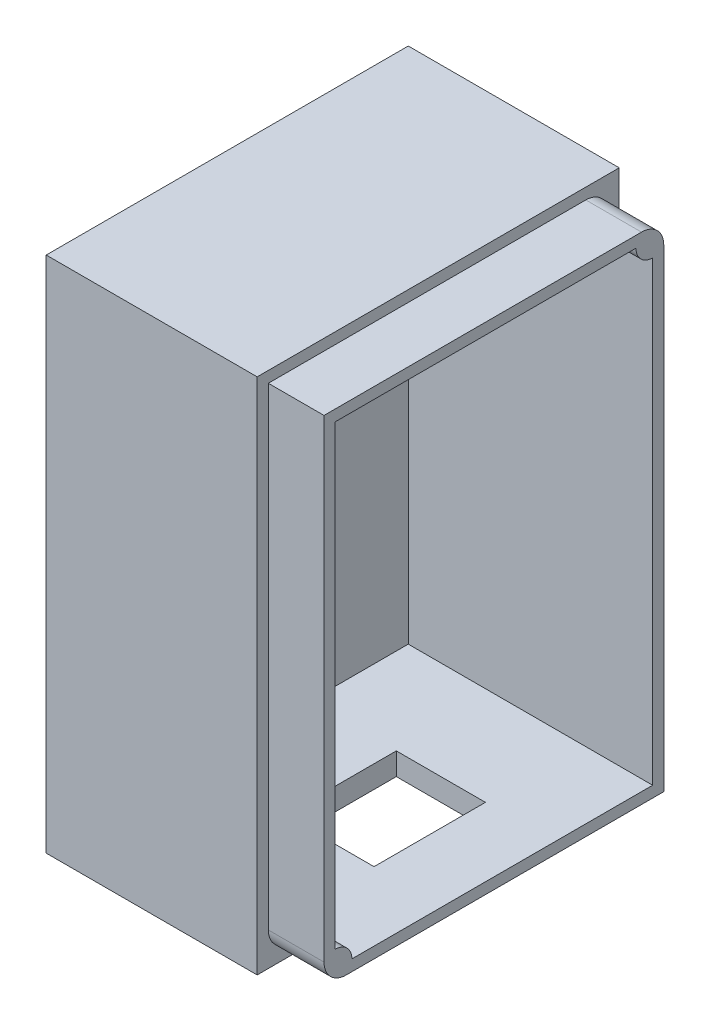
ISO-10303-21;
HEADER;
FILE_DESCRIPTION(('STEP AP214'),'2;1');
FILE_NAME('part.step','',(''),(''),'','','');
FILE_SCHEMA(('AUTOMOTIVE_DESIGN { 1 0 10303 214 1 1 1 1 }'));
ENDSEC;
DATA;
#1=APPLICATION_CONTEXT('core data for automotive mechanical design processes');
#2=APPLICATION_PROTOCOL_DEFINITION('international standard','automotive_design',2000,#1);
#3=PRODUCT_CONTEXT('',#1,'mechanical');
#4=PRODUCT('Part','Part','',(#3));
#5=PRODUCT_RELATED_PRODUCT_CATEGORY('part','',(#4));
#6=PRODUCT_DEFINITION_FORMATION('','',#4);
#7=PRODUCT_DEFINITION_CONTEXT('part definition',#1,'design');
#8=PRODUCT_DEFINITION('design','',#6,#7);
#9=PRODUCT_DEFINITION_SHAPE('','',#8);
#10=(LENGTH_UNIT() NAMED_UNIT(*) SI_UNIT(.MILLI.,.METRE.));
#11=(NAMED_UNIT(*) PLANE_ANGLE_UNIT() SI_UNIT($,.RADIAN.));
#12=(NAMED_UNIT(*) SI_UNIT($,.STERADIAN.) SOLID_ANGLE_UNIT());
#13=UNCERTAINTY_MEASURE_WITH_UNIT(LENGTH_MEASURE(1.E-05),#10,'distance_accuracy_value','');
#14=(GEOMETRIC_REPRESENTATION_CONTEXT(3) GLOBAL_UNCERTAINTY_ASSIGNED_CONTEXT((#13)) GLOBAL_UNIT_ASSIGNED_CONTEXT((#10,
#11,#12)) REPRESENTATION_CONTEXT('',''));
#15=CARTESIAN_POINT('',(0.,0.,0.));
#16=DIRECTION('',(0.,0.,1.));
#17=DIRECTION('',(1.,0.,0.));
#18=AXIS2_PLACEMENT_3D('',#15,#16,#17);
#19=CARTESIAN_POINT('',(20.,16.141592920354,16.5022123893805));
#20=DIRECTION('',(0.,0.,-1.));
#21=DIRECTION('',(0.,1.,0.));
#22=AXIS2_PLACEMENT_3D('',#19,#20,#21);
#23=PLANE('',#22);
#24=DIRECTION('',(-1.,0.,0.));
#25=VECTOR('',#24,1.);
#26=CARTESIAN_POINT('',(20.,-28.358407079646,16.5022123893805));
#27=LINE('',#26,#25);
#28=CARTESIAN_POINT('',(16.9379247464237,-28.358407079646,16.5022123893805));
#29=VERTEX_POINT('',#28);
#30=CARTESIAN_POINT('',(-2.,-28.358407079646,16.5022123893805));
#31=VERTEX_POINT('',#30);
#32=EDGE_CURVE('E550',#29,#31,#27,.T.);
#33=ORIENTED_EDGE('',*,*,#32,.F.);
#34=DIRECTION('',(0.,-1.,0.));
#35=VECTOR('',#34,1.);
#36=CARTESIAN_POINT('',(16.9379247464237,18.141592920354,16.5022123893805));
#37=LINE('',#36,#35);
#38=CARTESIAN_POINT('',(16.9379247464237,18.141592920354,16.5022123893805));
#39=VERTEX_POINT('',#38);
#40=EDGE_CURVE('E313',#39,#29,#37,.T.);
#41=ORIENTED_EDGE('',*,*,#40,.F.);
#42=DIRECTION('',(-1.,0.,0.));
#43=VECTOR('',#42,1.);
#44=CARTESIAN_POINT('',(20.,18.141592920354,16.5022123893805));
#45=LINE('',#44,#43);
#46=CARTESIAN_POINT('',(-2.,18.141592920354,16.5022123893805));
#47=VERTEX_POINT('',#46);
#48=EDGE_CURVE('E555',#39,#47,#45,.T.);
#49=ORIENTED_EDGE('',*,*,#48,.T.);
#50=DIRECTION('',(0.,-1.,0.));
#51=VECTOR('',#50,1.);
#52=CARTESIAN_POINT('',(-2.,16.141592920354,16.5022123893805));
#53=LINE('',#52,#51);
#54=EDGE_CURVE('E545',#47,#31,#53,.T.);
#55=ORIENTED_EDGE('',*,*,#54,.T.);
#56=EDGE_LOOP('',(#33,#41,#49,#55));
#57=FACE_BOUND('',#56,.T.);
#58=ADVANCED_FACE('F44',(#57),#23,.F.);
#59=CARTESIAN_POINT('',(20.,-28.358407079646,14.5022123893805));
#60=DIRECTION('',(0.,1.,0.));
#61=DIRECTION('',(0.,0.,1.));
#62=AXIS2_PLACEMENT_3D('',#59,#60,#61);
#63=PLANE('',#62);
#64=DIRECTION('',(0.,0.,-1.));
#65=VECTOR('',#64,1.);
#66=CARTESIAN_POINT('',(15.7624383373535,-28.358407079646,4.83698579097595));
#67=LINE('',#66,#65);
#68=CARTESIAN_POINT('',(15.7624383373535,-28.358407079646,4.83698579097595));
#69=VERTEX_POINT('',#68);
#70=CARTESIAN_POINT('',(15.7624383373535,-28.358407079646,-5.16301420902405));
#71=VERTEX_POINT('',#70);
#72=EDGE_CURVE('E327',#69,#71,#67,.T.);
#73=ORIENTED_EDGE('',*,*,#72,.T.);
#74=DIRECTION('',(1.,0.,0.));
#75=VECTOR('',#74,1.);
#76=CARTESIAN_POINT('',(7.76243833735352,-28.358407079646,-5.16301420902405));
#77=LINE('',#76,#75);
#78=CARTESIAN_POINT('',(7.76243833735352,-28.358407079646,-5.16301420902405));
#79=VERTEX_POINT('',#78);
#80=EDGE_CURVE('E319',#79,#71,#77,.T.);
#81=ORIENTED_EDGE('',*,*,#80,.F.);
#82=DIRECTION('',(0.,0.,-1.));
#83=VECTOR('',#82,1.);
#84=CARTESIAN_POINT('',(7.76243833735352,-28.358407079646,4.83698579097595));
#85=LINE('',#84,#83);
#86=CARTESIAN_POINT('',(7.76243833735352,-28.358407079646,4.83698579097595));
#87=VERTEX_POINT('',#86);
#88=EDGE_CURVE('E335',#87,#79,#85,.T.);
#89=ORIENTED_EDGE('',*,*,#88,.F.);
#90=DIRECTION('',(1.,0.,0.));
#91=VECTOR('',#90,1.);
#92=CARTESIAN_POINT('',(7.76243833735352,-28.358407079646,4.83698579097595));
#93=LINE('',#92,#91);
#94=EDGE_CURVE('E331',#87,#69,#93,.T.);
#95=ORIENTED_EDGE('',*,*,#94,.T.);
#96=EDGE_LOOP('',(#73,#81,#89,#95));
#97=FACE_BOUND('',#96,.T.);
#98=DIRECTION('',(0.,0.,-1.));
#99=VECTOR('',#98,1.);
#100=CARTESIAN_POINT('',(16.9379247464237,-28.358407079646,-15.9977876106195));
#101=LINE('',#100,#99);
#102=CARTESIAN_POINT('',(16.9379247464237,-28.358407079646,-15.9977876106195));
#103=VERTEX_POINT('',#102);
#104=EDGE_CURVE('E281',#29,#103,#101,.T.);
#105=ORIENTED_EDGE('',*,*,#104,.F.);
#106=ORIENTED_EDGE('',*,*,#32,.T.);
#107=DIRECTION('',(0.,0.,-1.));
#108=VECTOR('',#107,1.);
#109=CARTESIAN_POINT('',(-2.,-28.358407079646,14.5022123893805));
#110=LINE('',#109,#108);
#111=CARTESIAN_POINT('',(-2.,-28.358407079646,-15.9977876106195));
#112=VERTEX_POINT('',#111);
#113=EDGE_CURVE('E549',#31,#112,#110,.T.);
#114=ORIENTED_EDGE('',*,*,#113,.T.);
#115=DIRECTION('',(-1.,0.,0.));
#116=VECTOR('',#115,1.);
#117=CARTESIAN_POINT('',(20.,-28.358407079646,-15.9977876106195));
#118=LINE('',#117,#116);
#119=EDGE_CURVE('E554',#103,#112,#118,.T.);
#120=ORIENTED_EDGE('',*,*,#119,.F.);
#121=EDGE_LOOP('',(#105,#106,#114,#120));
#122=FACE_BOUND('',#121,.T.);
#123=ADVANCED_FACE('F685',(#97,#122),#63,.F.);
#124=CARTESIAN_POINT('',(7.,6.14159292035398,0.252212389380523));
#125=DIRECTION('',(-1.,0.,0.));
#126=DIRECTION('',(0.,0.,1.));
#127=AXIS2_PLACEMENT_3D('',#124,#125,#126);
#128=CYLINDRICAL_SURFACE('',#127,5.);
#129=CARTESIAN_POINT('',(-2.,6.14159292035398,0.252212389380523));
#130=DIRECTION('',(-1.,0.,0.));
#131=DIRECTION('',(0.,0.,1.));
#132=AXIS2_PLACEMENT_3D('',#129,#130,#131);
#133=CIRCLE('',#132,5.);
#134=CARTESIAN_POINT('',(-2.,6.14159292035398,5.25221238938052));
#135=VERTEX_POINT('',#134);
#136=EDGE_CURVE('E508',#135,#135,#133,.T.);
#137=ORIENTED_EDGE('',*,*,#136,.T.);
#138=EDGE_LOOP('',(#137));
#139=FACE_BOUND('',#138,.T.);
#140=CARTESIAN_POINT('',(-0.999999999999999,6.14159292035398,0.252212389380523));
#141=DIRECTION('',(1.,0.,0.));
#142=DIRECTION('',(0.,0.,-1.));
#143=AXIS2_PLACEMENT_3D('',#140,#141,#142);
#144=CIRCLE('',#143,5.);
#145=CARTESIAN_POINT('',(-0.999999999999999,6.14159292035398,-4.74778761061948));
#146=VERTEX_POINT('',#145);
#147=EDGE_CURVE('E435',#146,#146,#144,.F.);
#148=ORIENTED_EDGE('',*,*,#147,.F.);
#149=EDGE_LOOP('',(#148));
#150=FACE_BOUND('',#149,.T.);
#151=ADVANCED_FACE('F691',(#139,#150),#128,.F.);
#152=CARTESIAN_POINT('',(20.,16.141592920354,-15.9977876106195));
#153=DIRECTION('',(0.,0.,1.));
#154=DIRECTION('',(0.,-1.,0.));
#155=AXIS2_PLACEMENT_3D('',#152,#153,#154);
#156=PLANE('',#155);
#157=DIRECTION('',(-1.,0.,0.));
#158=VECTOR('',#157,1.);
#159=CARTESIAN_POINT('',(20.,18.141592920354,-15.9977876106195));
#160=LINE('',#159,#158);
#161=CARTESIAN_POINT('',(16.9379247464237,18.141592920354,-15.9977876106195));
#162=VERTEX_POINT('',#161);
#163=CARTESIAN_POINT('',(-2.,18.141592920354,-15.9977876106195));
#164=VERTEX_POINT('',#163);
#165=EDGE_CURVE('E558',#162,#164,#160,.T.);
#166=ORIENTED_EDGE('',*,*,#165,.F.);
#167=DIRECTION('',(0.,1.,0.));
#168=VECTOR('',#167,1.);
#169=CARTESIAN_POINT('',(16.9379247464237,18.141592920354,-15.9977876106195));
#170=LINE('',#169,#168);
#171=EDGE_CURVE('E307',#103,#162,#170,.T.);
#172=ORIENTED_EDGE('',*,*,#171,.F.);
#173=ORIENTED_EDGE('',*,*,#119,.T.);
#174=DIRECTION('',(0.,1.,0.));
#175=VECTOR('',#174,1.);
#176=CARTESIAN_POINT('',(-2.,16.141592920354,-15.9977876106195));
#177=LINE('',#176,#175);
#178=EDGE_CURVE('E563',#112,#164,#177,.T.);
#179=ORIENTED_EDGE('',*,*,#178,.T.);
#180=EDGE_LOOP('',(#166,#172,#173,#179));
#181=FACE_BOUND('',#180,.T.);
#182=ADVANCED_FACE('F698',(#181),#156,.F.);
#183=CARTESIAN_POINT('',(20.,18.141592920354,14.5022123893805));
#184=DIRECTION('',(0.,-1.,0.));
#185=DIRECTION('',(0.,0.,-1.));
#186=AXIS2_PLACEMENT_3D('',#183,#184,#185);
#187=PLANE('',#186);
#188=ORIENTED_EDGE('',*,*,#48,.F.);
#189=DIRECTION('',(0.,0.,1.));
#190=VECTOR('',#189,1.);
#191=CARTESIAN_POINT('',(16.9379247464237,18.141592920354,-15.9977876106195));
#192=LINE('',#191,#190);
#193=EDGE_CURVE('E310',#162,#39,#192,.T.);
#194=ORIENTED_EDGE('',*,*,#193,.F.);
#195=ORIENTED_EDGE('',*,*,#165,.T.);
#196=DIRECTION('',(0.,0.,1.));
#197=VECTOR('',#196,1.);
#198=CARTESIAN_POINT('',(-2.,18.141592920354,14.5022123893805));
#199=LINE('',#198,#197);
#200=EDGE_CURVE('E559',#164,#47,#199,.T.);
#201=ORIENTED_EDGE('',*,*,#200,.T.);
#202=EDGE_LOOP('',(#188,#194,#195,#201));
#203=FACE_BOUND('',#202,.T.);
#204=ADVANCED_FACE('F701',(#203),#187,.F.);
#205=CARTESIAN_POINT('',(-2.,0.,0.));
#206=DIRECTION('',(1.,0.,0.));
#207=DIRECTION('',(0.,0.,-1.));
#208=AXIS2_PLACEMENT_3D('',#205,#206,#207);
#209=PLANE('',#208);
#210=ORIENTED_EDGE('',*,*,#136,.F.);
#211=EDGE_LOOP('',(#210));
#212=FACE_BOUND('',#211,.T.);
#213=DIRECTION('',(0.,0.933474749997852,0.358643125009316));
#214=VECTOR('',#213,1.);
#215=CARTESIAN_POINT('',(-2.,-17.7749650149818,13.8253044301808));
#216=LINE('',#215,#214);
#217=CARTESIAN_POINT('',(-2.,-17.7749650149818,13.8253044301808));
#218=VERTEX_POINT('',#217);
#219=CARTESIAN_POINT('',(-2.,-14.1924692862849,15.2017074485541));
#220=VERTEX_POINT('',#219);
#221=EDGE_CURVE('E448',#218,#220,#216,.T.);
#222=ORIENTED_EDGE('',*,*,#221,.F.);
#223=DIRECTION('',(0.,0.15614331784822,0.987734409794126));
#224=VECTOR('',#223,1.);
#225=CARTESIAN_POINT('',(-2.,-18.3742128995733,10.0345706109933));
#226=LINE('',#225,#224);
#227=CARTESIAN_POINT('',(-2.,-18.1794698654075,11.2664798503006));
#228=VERTEX_POINT('',#227);
#229=EDGE_CURVE('E449',#228,#218,#226,.T.);
#230=ORIENTED_EDGE('',*,*,#229,.F.);
#231=DIRECTION('',(0.,0.320865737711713,0.947124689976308));
#232=VECTOR('',#231,1.);
#233=CARTESIAN_POINT('',(-2.,-18.1893486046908,11.2373199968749));
#234=LINE('',#233,#232);
#235=CARTESIAN_POINT('',(-2.,-18.1893486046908,11.2373199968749));
#236=VERTEX_POINT('',#235);
#237=EDGE_CURVE('E519',#236,#228,#234,.T.);
#238=ORIENTED_EDGE('',*,*,#237,.F.);
#239=DIRECTION('',(0.,-0.659801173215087,0.751440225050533));
#240=VECTOR('',#239,1.);
#241=CARTESIAN_POINT('',(-2.,-16.284666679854,9.06809891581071));
#242=LINE('',#241,#240);
#243=CARTESIAN_POINT('',(-2.,-18.184883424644,11.2322346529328));
#244=VERTEX_POINT('',#243);
#245=EDGE_CURVE('E516',#244,#236,#242,.T.);
#246=ORIENTED_EDGE('',*,*,#245,.F.);
#247=CARTESIAN_POINT('',(-2.,-18.3742128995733,10.0345706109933));
#248=VERTEX_POINT('',#247);
#249=EDGE_CURVE('E445',#248,#244,#226,.T.);
#250=ORIENTED_EDGE('',*,*,#249,.F.);
#251=DIRECTION('',(0.,-0.777331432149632,0.629091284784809));
#252=VECTOR('',#251,1.);
#253=CARTESIAN_POINT('',(-2.,-15.390965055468,7.62023981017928));
#254=LINE('',#253,#252);
#255=CARTESIAN_POINT('',(-2.,-15.390965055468,7.62023981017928));
#256=VERTEX_POINT('',#255);
#257=EDGE_CURVE('E465',#256,#248,#254,.T.);
#258=ORIENTED_EDGE('',*,*,#257,.F.);
#259=DIRECTION('',(0.,-0.933474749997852,-0.358643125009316));
#260=VECTOR('',#259,1.);
#261=CARTESIAN_POINT('',(-2.,-11.8084693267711,8.99664282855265));
#262=LINE('',#261,#260);
#263=CARTESIAN_POINT('',(-2.,-11.8084693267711,8.99664282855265));
#264=VERTEX_POINT('',#263);
#265=EDGE_CURVE('E461',#264,#256,#262,.T.);
#266=ORIENTED_EDGE('',*,*,#265,.F.);
#267=DIRECTION('',(0.,-0.15614331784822,-0.987734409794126));
#268=VECTOR('',#267,1.);
#269=CARTESIAN_POINT('',(-2.,-11.2092214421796,12.7873766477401));
#270=LINE('',#269,#268);
#271=CARTESIAN_POINT('',(-2.,-11.2092214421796,12.7873766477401));
#272=VERTEX_POINT('',#271);
#273=EDGE_CURVE('E457',#272,#264,#270,.T.);
#274=ORIENTED_EDGE('',*,*,#273,.F.);
#275=DIRECTION('',(0.,0.777331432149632,-0.629091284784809));
#276=VECTOR('',#275,1.);
#277=CARTESIAN_POINT('',(-2.,-14.1924692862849,15.2017074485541));
#278=LINE('',#277,#276);
#279=EDGE_CURVE('E453',#220,#272,#278,.T.);
#280=ORIENTED_EDGE('',*,*,#279,.F.);
#281=EDGE_LOOP('',(#222,#230,#238,#246,#250,#258,#266,#274,#280));
#282=FACE_BOUND('',#281,.T.);
#283=ORIENTED_EDGE('',*,*,#54,.F.);
#284=ORIENTED_EDGE('',*,*,#200,.F.);
#285=ORIENTED_EDGE('',*,*,#178,.F.);
#286=ORIENTED_EDGE('',*,*,#113,.F.);
#287=EDGE_LOOP('',(#283,#284,#285,#286));
#288=FACE_BOUND('',#287,.T.);
#289=ADVANCED_FACE('F651',(#212,#282,#288),#209,.F.);
#290=CARTESIAN_POINT('',(20.,16.141592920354,14.5022123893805));
#291=DIRECTION('',(0.,0.,-1.));
#292=DIRECTION('',(0.,1.,0.));
#293=AXIS2_PLACEMENT_3D('',#290,#291,#292);
#294=PLANE('',#293);
#295=DIRECTION('',(1.,0.,0.));
#296=VECTOR('',#295,1.);
#297=CARTESIAN_POINT('',(-2.,-24.858407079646,14.5022123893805));
#298=LINE('',#297,#296);
#299=CARTESIAN_POINT('',(0.,-24.858407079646,14.5022123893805));
#300=VERTEX_POINT('',#299);
#301=CARTESIAN_POINT('',(21.9379247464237,-24.858407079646,14.5022123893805));
#302=VERTEX_POINT('',#301);
#303=EDGE_CURVE('E380',#300,#302,#298,.T.);
#304=ORIENTED_EDGE('',*,*,#303,.F.);
#305=DIRECTION('',(0.,-1.,0.));
#306=VECTOR('',#305,1.);
#307=CARTESIAN_POINT('',(0.,16.141592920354,14.5022123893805));
#308=LINE('',#307,#306);
#309=CARTESIAN_POINT('',(0.,-16.0131119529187,14.5022123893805));
#310=VERTEX_POINT('',#309);
#311=EDGE_CURVE('E523',#310,#300,#308,.T.);
#312=ORIENTED_EDGE('',*,*,#311,.F.);
#313=DIRECTION('',(-1.,0.,0.));
#314=VECTOR('',#313,1.);
#315=CARTESIAN_POINT('',(20.,-16.0131119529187,14.5022123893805));
#316=LINE('',#315,#314);
#317=CARTESIAN_POINT('',(5.9379247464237,-16.0131119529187,14.5022123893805));
#318=VERTEX_POINT('',#317);
#319=EDGE_CURVE('E473',#318,#310,#316,.T.);
#320=ORIENTED_EDGE('',*,*,#319,.F.);
#321=DIRECTION('',(0.,-1.,0.));
#322=VECTOR('',#321,1.);
#323=CARTESIAN_POINT('',(5.9379247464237,-26.358407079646,14.5022123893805));
#324=LINE('',#323,#322);
#325=CARTESIAN_POINT('',(5.9379247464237,-13.3281440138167,14.5022123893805));
#326=VERTEX_POINT('',#325);
#327=EDGE_CURVE('E384',#326,#318,#324,.T.);
#328=ORIENTED_EDGE('',*,*,#327,.F.);
#329=DIRECTION('',(1.,0.,0.));
#330=VECTOR('',#329,1.);
#331=CARTESIAN_POINT('',(20.,-13.3281440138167,14.5022123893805));
#332=LINE('',#331,#330);
#333=CARTESIAN_POINT('',(0.,-13.3281440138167,14.5022123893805));
#334=VERTEX_POINT('',#333);
#335=EDGE_CURVE('E494',#334,#326,#332,.T.);
#336=ORIENTED_EDGE('',*,*,#335,.F.);
#337=CARTESIAN_POINT('',(0.,16.141592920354,14.5022123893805));
#338=VERTEX_POINT('',#337);
#339=EDGE_CURVE('E524',#338,#334,#308,.T.);
#340=ORIENTED_EDGE('',*,*,#339,.F.);
#341=DIRECTION('',(-1.,0.,0.));
#342=VECTOR('',#341,1.);
#343=CARTESIAN_POINT('',(20.,16.141592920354,14.5022123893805));
#344=LINE('',#343,#342);
#345=CARTESIAN_POINT('',(21.9379247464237,16.141592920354,14.5022123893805));
#346=VERTEX_POINT('',#345);
#347=EDGE_CURVE('E537',#346,#338,#344,.T.);
#348=ORIENTED_EDGE('',*,*,#347,.F.);
#349=DIRECTION('',(0.,-1.,0.));
#350=VECTOR('',#349,1.);
#351=CARTESIAN_POINT('',(21.9379247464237,-26.358407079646,14.5022123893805));
#352=LINE('',#351,#350);
#353=EDGE_CURVE('E385',#346,#302,#352,.T.);
#354=ORIENTED_EDGE('',*,*,#353,.T.);
#355=EDGE_LOOP('',(#304,#312,#320,#328,#336,#340,#348,#354));
#356=FACE_BOUND('',#355,.T.);
#357=ADVANCED_FACE('F666',(#356),#294,.T.);
#358=CARTESIAN_POINT('',(20.,-26.358407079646,14.5022123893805));
#359=DIRECTION('',(0.,1.,0.));
#360=DIRECTION('',(0.,0.,1.));
#361=AXIS2_PLACEMENT_3D('',#358,#359,#360);
#362=PLANE('',#361);
#363=DIRECTION('',(-1.,0.,0.));
#364=VECTOR('',#363,1.);
#365=CARTESIAN_POINT('',(20.,-26.358407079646,-5.16301420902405));
#366=LINE('',#365,#364);
#367=CARTESIAN_POINT('',(15.7624383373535,-26.358407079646,-5.16301420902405));
#368=VERTEX_POINT('',#367);
#369=CARTESIAN_POINT('',(7.76243833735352,-26.358407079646,-5.16301420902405));
#370=VERTEX_POINT('',#369);
#371=EDGE_CURVE('E615',#368,#370,#366,.T.);
#372=ORIENTED_EDGE('',*,*,#371,.F.);
#373=DIRECTION('',(0.,0.,1.));
#374=VECTOR('',#373,1.);
#375=CARTESIAN_POINT('',(15.7624383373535,-26.358407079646,14.5022123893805));
#376=LINE('',#375,#374);
#377=CARTESIAN_POINT('',(15.7624383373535,-26.358407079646,4.83698579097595));
#378=VERTEX_POINT('',#377);
#379=EDGE_CURVE('E601',#368,#378,#376,.T.);
#380=ORIENTED_EDGE('',*,*,#379,.T.);
#381=DIRECTION('',(-1.,0.,0.));
#382=VECTOR('',#381,1.);
#383=CARTESIAN_POINT('',(20.,-26.358407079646,4.83698579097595));
#384=LINE('',#383,#382);
#385=CARTESIAN_POINT('',(7.76243833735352,-26.358407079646,4.83698579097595));
#386=VERTEX_POINT('',#385);
#387=EDGE_CURVE('E608',#378,#386,#384,.T.);
#388=ORIENTED_EDGE('',*,*,#387,.T.);
#389=DIRECTION('',(0.,0.,1.));
#390=VECTOR('',#389,1.);
#391=CARTESIAN_POINT('',(7.76243833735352,-26.358407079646,14.5022123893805));
#392=LINE('',#391,#390);
#393=EDGE_CURVE('E612',#370,#386,#392,.T.);
#394=ORIENTED_EDGE('',*,*,#393,.F.);
#395=EDGE_LOOP('',(#372,#380,#388,#394));
#396=FACE_BOUND('',#395,.T.);
#397=DIRECTION('',(1.,0.,0.));
#398=VECTOR('',#397,1.);
#399=CARTESIAN_POINT('',(-2.,-26.358407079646,13.0022123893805));
#400=LINE('',#399,#398);
#401=CARTESIAN_POINT('',(21.9379247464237,-26.358407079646,13.0022123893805));
#402=VERTEX_POINT('',#401);
#403=CARTESIAN_POINT('',(0.,-26.358407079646,13.0022123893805));
#404=VERTEX_POINT('',#403);
#405=EDGE_CURVE('E376',#402,#404,#400,.F.);
#406=ORIENTED_EDGE('',*,*,#405,.F.);
#407=DIRECTION('',(0.,0.,-1.));
#408=VECTOR('',#407,1.);
#409=CARTESIAN_POINT('',(21.9379247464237,-26.358407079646,-13.9977876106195));
#410=LINE('',#409,#408);
#411=CARTESIAN_POINT('',(21.9379247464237,-26.358407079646,-13.9977876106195));
#412=VERTEX_POINT('',#411);
#413=EDGE_CURVE('E388',#402,#412,#410,.T.);
#414=ORIENTED_EDGE('',*,*,#413,.T.);
#415=DIRECTION('',(-1.,0.,0.));
#416=VECTOR('',#415,1.);
#417=CARTESIAN_POINT('',(20.,-26.358407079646,-13.9977876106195));
#418=LINE('',#417,#416);
#419=CARTESIAN_POINT('',(0.,-26.358407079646,-13.9977876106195));
#420=VERTEX_POINT('',#419);
#421=EDGE_CURVE('E541',#412,#420,#418,.T.);
#422=ORIENTED_EDGE('',*,*,#421,.T.);
#423=DIRECTION('',(0.,0.,-1.));
#424=VECTOR('',#423,1.);
#425=CARTESIAN_POINT('',(0.,-26.358407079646,14.5022123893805));
#426=LINE('',#425,#424);
#427=EDGE_CURVE('E528',#404,#420,#426,.T.);
#428=ORIENTED_EDGE('',*,*,#427,.F.);
#429=EDGE_LOOP('',(#406,#414,#422,#428));
#430=FACE_BOUND('',#429,.T.);
#431=ADVANCED_FACE('F770',(#396,#430),#362,.T.);
#432=CARTESIAN_POINT('',(20.,16.141592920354,-13.9977876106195));
#433=DIRECTION('',(0.,0.,1.));
#434=DIRECTION('',(0.,-1.,0.));
#435=AXIS2_PLACEMENT_3D('',#432,#433,#434);
#436=PLANE('',#435);
#437=DIRECTION('',(1.,0.,0.));
#438=VECTOR('',#437,1.);
#439=CARTESIAN_POINT('',(-2.,14.6423659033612,-13.9977876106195));
#440=LINE('',#439,#438);
#441=CARTESIAN_POINT('',(0.,14.6423659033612,-13.9977876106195));
#442=VERTEX_POINT('',#441);
#443=CARTESIAN_POINT('',(21.9379247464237,14.6423659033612,-13.9977876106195));
#444=VERTEX_POINT('',#443);
#445=EDGE_CURVE('E364',#442,#444,#440,.T.);
#446=ORIENTED_EDGE('',*,*,#445,.F.);
#447=DIRECTION('',(0.,1.,0.));
#448=VECTOR('',#447,1.);
#449=CARTESIAN_POINT('',(0.,16.141592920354,-13.9977876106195));
#450=LINE('',#449,#448);
#451=EDGE_CURVE('E531',#420,#442,#450,.T.);
#452=ORIENTED_EDGE('',*,*,#451,.F.);
#453=ORIENTED_EDGE('',*,*,#421,.F.);
#454=DIRECTION('',(0.,1.,0.));
#455=VECTOR('',#454,1.);
#456=CARTESIAN_POINT('',(21.9379247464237,16.141592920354,-13.9977876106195));
#457=LINE('',#456,#455);
#458=EDGE_CURVE('E391',#412,#444,#457,.T.);
#459=ORIENTED_EDGE('',*,*,#458,.T.);
#460=EDGE_LOOP('',(#446,#452,#453,#459));
#461=FACE_BOUND('',#460,.T.);
#462=ADVANCED_FACE('F777',(#461),#436,.T.);
#463=CARTESIAN_POINT('',(20.,16.141592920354,14.5022123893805));
#464=DIRECTION('',(0.,-1.,0.));
#465=DIRECTION('',(0.,0.,-1.));
#466=AXIS2_PLACEMENT_3D('',#463,#464,#465);
#467=PLANE('',#466);
#468=DIRECTION('',(1.,0.,0.));
#469=VECTOR('',#468,1.);
#470=CARTESIAN_POINT('',(-2.,16.141592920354,-12.4985605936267));
#471=LINE('',#470,#469);
#472=CARTESIAN_POINT('',(21.9379247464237,16.141592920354,-12.4985605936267));
#473=VERTEX_POINT('',#472);
#474=CARTESIAN_POINT('',(0.,16.141592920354,-12.4985605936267));
#475=VERTEX_POINT('',#474);
#476=EDGE_CURVE('E360',#473,#475,#471,.F.);
#477=ORIENTED_EDGE('',*,*,#476,.F.);
#478=DIRECTION('',(0.,0.,1.));
#479=VECTOR('',#478,1.);
#480=CARTESIAN_POINT('',(21.9379247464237,16.141592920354,14.5022123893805));
#481=LINE('',#480,#479);
#482=EDGE_CURVE('E394',#473,#346,#481,.T.);
#483=ORIENTED_EDGE('',*,*,#482,.T.);
#484=ORIENTED_EDGE('',*,*,#347,.T.);
#485=DIRECTION('',(0.,0.,1.));
#486=VECTOR('',#485,1.);
#487=CARTESIAN_POINT('',(0.,16.141592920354,14.5022123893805));
#488=LINE('',#487,#486);
#489=EDGE_CURVE('E534',#475,#338,#488,.T.);
#490=ORIENTED_EDGE('',*,*,#489,.F.);
#491=EDGE_LOOP('',(#477,#483,#484,#490));
#492=FACE_BOUND('',#491,.T.);
#493=ADVANCED_FACE('F780',(#492),#467,.T.);
#494=CARTESIAN_POINT('',(0.,0.,0.));
#495=DIRECTION('',(1.,0.,0.));
#496=DIRECTION('',(0.,0.,-1.));
#497=AXIS2_PLACEMENT_3D('',#494,#495,#496);
#498=PLANE('',#497);
#499=CARTESIAN_POINT('',(0.,16.141592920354,-13.9977876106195));
#500=DIRECTION('',(1.,0.,0.));
#501=DIRECTION('',(0.,0.,-1.));
#502=AXIS2_PLACEMENT_3D('',#499,#500,#501);
#503=CIRCLE('',#502,1.4992270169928);
#504=EDGE_CURVE('E356',#475,#442,#503,.T.);
#505=ORIENTED_EDGE('',*,*,#504,.F.);
#506=ORIENTED_EDGE('',*,*,#489,.T.);
#507=ORIENTED_EDGE('',*,*,#339,.T.);
#508=DIRECTION('',(0.,-0.777331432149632,0.629091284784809));
#509=VECTOR('',#508,1.);
#510=CARTESIAN_POINT('',(0.,1.81707122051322,2.2452489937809));
#511=LINE('',#510,#509);
#512=CARTESIAN_POINT('',(0.,-11.2092214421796,12.7873766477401));
#513=VERTEX_POINT('',#512);
#514=EDGE_CURVE('E497',#513,#334,#511,.T.);
#515=ORIENTED_EDGE('',*,*,#514,.F.);
#516=DIRECTION('',(0.,0.15614331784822,0.987734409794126));
#517=VECTOR('',#516,1.);
#518=CARTESIAN_POINT('',(0.,-12.908105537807,2.0405428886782));
#519=LINE('',#518,#517);
#520=CARTESIAN_POINT('',(0.,-11.8084693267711,8.99664282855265));
#521=VERTEX_POINT('',#520);
#522=EDGE_CURVE('E592',#521,#513,#519,.T.);
#523=ORIENTED_EDGE('',*,*,#522,.F.);
#524=DIRECTION('',(0.,0.933474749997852,0.358643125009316));
#525=VECTOR('',#524,1.);
#526=CARTESIAN_POINT('',(0.,-4.53079786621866,11.7927407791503));
#527=LINE('',#526,#525);
#528=CARTESIAN_POINT('',(0.,-15.390965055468,7.62023981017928));
#529=VERTEX_POINT('',#528);
#530=EDGE_CURVE('E595',#529,#521,#527,.T.);
#531=ORIENTED_EDGE('',*,*,#530,.F.);
#532=DIRECTION('',(0.,0.777331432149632,-0.629091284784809));
#533=VECTOR('',#532,1.);
#534=CARTESIAN_POINT('',(0.,-2.36467239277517,-2.92188784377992));
#535=LINE('',#534,#533);
#536=CARTESIAN_POINT('',(0.,-18.3742128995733,10.0345706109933));
#537=VERTEX_POINT('',#536);
#538=EDGE_CURVE('E598',#537,#529,#535,.T.);
#539=ORIENTED_EDGE('',*,*,#538,.F.);
#540=DIRECTION('',(0.,-0.15614331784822,-0.987734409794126));
#541=VECTOR('',#540,1.);
#542=CARTESIAN_POINT('',(0.,-19.4738491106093,3.07847067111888));
#543=LINE('',#542,#541);
#544=CARTESIAN_POINT('',(0.,-18.184883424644,11.2322346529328));
#545=VERTEX_POINT('',#544);
#546=EDGE_CURVE('E500',#545,#537,#543,.T.);
#547=ORIENTED_EDGE('',*,*,#546,.F.);
#548=DIRECTION('',(0.,0.659801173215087,-0.751440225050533));
#549=VECTOR('',#548,1.);
#550=CARTESIAN_POINT('',(0.,-4.69936536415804,-4.1262720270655));
#551=LINE('',#550,#549);
#552=CARTESIAN_POINT('',(0.,-18.1893486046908,11.2373199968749));
#553=VERTEX_POINT('',#552);
#554=EDGE_CURVE('E576',#553,#545,#551,.T.);
#555=ORIENTED_EDGE('',*,*,#554,.F.);
#556=DIRECTION('',(0.,-0.320865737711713,-0.947124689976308));
#557=VECTOR('',#556,1.);
#558=CARTESIAN_POINT('',(0.,-19.7316874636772,6.68467681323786));
#559=LINE('',#558,#557);
#560=CARTESIAN_POINT('',(0.,-18.1794698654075,11.2664798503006));
#561=VERTEX_POINT('',#560);
#562=EDGE_CURVE('E553',#561,#553,#559,.T.);
#563=ORIENTED_EDGE('',*,*,#562,.F.);
#564=CARTESIAN_POINT('',(0.,-17.7749650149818,13.8253044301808));
#565=VERTEX_POINT('',#564);
#566=EDGE_CURVE('E504',#565,#561,#543,.T.);
#567=ORIENTED_EDGE('',*,*,#566,.F.);
#568=DIRECTION('',(0.,-0.933474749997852,-0.358643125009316));
#569=VECTOR('',#568,1.);
#570=CARTESIAN_POINT('',(0.,-6.9147978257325,17.9978053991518));
#571=LINE('',#570,#569);
#572=EDGE_CURVE('E491',#310,#565,#571,.T.);
#573=ORIENTED_EDGE('',*,*,#572,.F.);
#574=ORIENTED_EDGE('',*,*,#311,.T.);
#575=CARTESIAN_POINT('',(0.,-26.358407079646,14.5022123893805));
#576=DIRECTION('',(1.,0.,0.));
#577=DIRECTION('',(0.,0.,-1.));
#578=AXIS2_PLACEMENT_3D('',#575,#576,#577);
#579=CIRCLE('',#578,1.5);
#580=EDGE_CURVE('E372',#404,#300,#579,.T.);
#581=ORIENTED_EDGE('',*,*,#580,.F.);
#582=ORIENTED_EDGE('',*,*,#427,.T.);
#583=ORIENTED_EDGE('',*,*,#451,.T.);
#584=EDGE_LOOP('',(#505,#506,#507,#515,#523,#531,#539,#547,#555,#563,#567,#573,#574,#581,#582,#583));
#585=FACE_BOUND('',#584,.T.);
#586=DIRECTION('',(0.,1.,0.));
#587=VECTOR('',#586,1.);
#588=CARTESIAN_POINT('',(0.,11.5863226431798,-5.18234597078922));
#589=LINE('',#588,#587);
#590=CARTESIAN_POINT('',(0.,0.696863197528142,-5.18234597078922));
#591=VERTEX_POINT('',#590);
#592=CARTESIAN_POINT('',(0.,11.5863226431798,-5.18234597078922));
#593=VERTEX_POINT('',#592);
#594=EDGE_CURVE('E397',#591,#593,#589,.T.);
#595=ORIENTED_EDGE('',*,*,#594,.F.);
#596=DIRECTION('',(0.,0.,-1.));
#597=VECTOR('',#596,1.);
#598=CARTESIAN_POINT('',(0.,0.696863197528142,5.68677074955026));
#599=LINE('',#598,#597);
#600=CARTESIAN_POINT('',(0.,0.696863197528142,5.68677074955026));
#601=VERTEX_POINT('',#600);
#602=EDGE_CURVE('E406',#601,#591,#599,.T.);
#603=ORIENTED_EDGE('',*,*,#602,.F.);
#604=DIRECTION('',(0.,-1.,0.));
#605=VECTOR('',#604,1.);
#606=CARTESIAN_POINT('',(0.,11.5863226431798,5.68677074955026));
#607=LINE('',#606,#605);
#608=CARTESIAN_POINT('',(0.,11.5863226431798,5.68677074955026));
#609=VERTEX_POINT('',#608);
#610=EDGE_CURVE('E425',#609,#601,#607,.T.);
#611=ORIENTED_EDGE('',*,*,#610,.F.);
#612=DIRECTION('',(0.,0.,1.));
#613=VECTOR('',#612,1.);
#614=CARTESIAN_POINT('',(0.,11.5863226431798,5.68677074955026));
#615=LINE('',#614,#613);
#616=EDGE_CURVE('E421',#593,#609,#615,.T.);
#617=ORIENTED_EDGE('',*,*,#616,.F.);
#618=EDGE_LOOP('',(#595,#603,#611,#617));
#619=FACE_BOUND('',#618,.T.);
#620=ADVANCED_FACE('F767',(#585,#619),#498,.T.);
#621=CARTESIAN_POINT('',(18.,-18.1893486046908,11.2373199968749));
#622=DIRECTION('',(0.,-0.947124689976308,0.320865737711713));
#623=DIRECTION('',(0.,-0.320865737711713,-0.947124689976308));
#624=AXIS2_PLACEMENT_3D('',#621,#622,#623);
#625=PLANE('',#624);
#626=ORIENTED_EDGE('',*,*,#237,.T.);
#627=DIRECTION('',(1.,0.,0.));
#628=VECTOR('',#627,1.);
#629=CARTESIAN_POINT('',(18.,-18.1794698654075,11.2664798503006));
#630=LINE('',#629,#628);
#631=EDGE_CURVE('E503',#228,#561,#630,.T.);
#632=ORIENTED_EDGE('',*,*,#631,.T.);
#633=ORIENTED_EDGE('',*,*,#562,.T.);
#634=DIRECTION('',(-1.,0.,0.));
#635=VECTOR('',#634,1.);
#636=CARTESIAN_POINT('',(18.,-18.1893486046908,11.2373199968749));
#637=LINE('',#636,#635);
#638=EDGE_CURVE('E512',#553,#236,#637,.T.);
#639=ORIENTED_EDGE('',*,*,#638,.T.);
#640=EDGE_LOOP('',(#626,#632,#633,#639));
#641=FACE_BOUND('',#640,.T.);
#642=ADVANCED_FACE('F809',(#641),#625,.F.);
#643=CARTESIAN_POINT('',(18.,-16.284666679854,9.06809891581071));
#644=DIRECTION('',(0.,-0.751440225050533,-0.659801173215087));
#645=DIRECTION('',(0.,0.659801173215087,-0.751440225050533));
#646=AXIS2_PLACEMENT_3D('',#643,#644,#645);
#647=PLANE('',#646);
#648=ORIENTED_EDGE('',*,*,#554,.T.);
#649=DIRECTION('',(-1.,0.,0.));
#650=VECTOR('',#649,1.);
#651=CARTESIAN_POINT('',(18.,-18.184883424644,11.2322346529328));
#652=LINE('',#651,#650);
#653=EDGE_CURVE('E588',#545,#244,#652,.T.);
#654=ORIENTED_EDGE('',*,*,#653,.T.);
#655=ORIENTED_EDGE('',*,*,#245,.T.);
#656=ORIENTED_EDGE('',*,*,#638,.F.);
#657=EDGE_LOOP('',(#648,#654,#655,#656));
#658=FACE_BOUND('',#657,.T.);
#659=ADVANCED_FACE('F806',(#658),#647,.F.);
#660=CARTESIAN_POINT('',(7.,-18.3742128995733,10.0345706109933));
#661=DIRECTION('',(0.,-0.987734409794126,0.15614331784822));
#662=DIRECTION('',(0.,-0.15614331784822,-0.987734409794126));
#663=AXIS2_PLACEMENT_3D('',#660,#661,#662);
#664=PLANE('',#663);
#665=ORIENTED_EDGE('',*,*,#566,.T.);
#666=ORIENTED_EDGE('',*,*,#631,.F.);
#667=ORIENTED_EDGE('',*,*,#229,.T.);
#668=DIRECTION('',(-1.,0.,0.));
#669=VECTOR('',#668,1.);
#670=CARTESIAN_POINT('',(7.,-17.7749650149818,13.8253044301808));
#671=LINE('',#670,#669);
#672=EDGE_CURVE('E469',#565,#218,#671,.T.);
#673=ORIENTED_EDGE('',*,*,#672,.F.);
#674=EDGE_LOOP('',(#665,#666,#667,#673));
#675=FACE_BOUND('',#674,.T.);
#676=ADVANCED_FACE('F642',(#675),#664,.F.);
#677=ORIENTED_EDGE('',*,*,#546,.T.);
#678=DIRECTION('',(-1.,0.,0.));
#679=VECTOR('',#678,1.);
#680=CARTESIAN_POINT('',(7.,-18.3742128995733,10.0345706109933));
#681=LINE('',#680,#679);
#682=EDGE_CURVE('E470',#537,#248,#681,.T.);
#683=ORIENTED_EDGE('',*,*,#682,.T.);
#684=ORIENTED_EDGE('',*,*,#249,.T.);
#685=ORIENTED_EDGE('',*,*,#653,.F.);
#686=EDGE_LOOP('',(#677,#683,#684,#685));
#687=FACE_BOUND('',#686,.T.);
#688=ADVANCED_FACE('F810',(#687),#664,.F.);
#689=CARTESIAN_POINT('',(7.,-15.390965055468,7.62023981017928));
#690=DIRECTION('',(0.,-0.629091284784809,-0.777331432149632));
#691=DIRECTION('',(0.,0.777331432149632,-0.629091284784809));
#692=AXIS2_PLACEMENT_3D('',#689,#690,#691);
#693=PLANE('',#692);
#694=ORIENTED_EDGE('',*,*,#538,.T.);
#695=DIRECTION('',(-1.,0.,0.));
#696=VECTOR('',#695,1.);
#697=CARTESIAN_POINT('',(7.,-15.390965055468,7.62023981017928));
#698=LINE('',#697,#696);
#699=EDGE_CURVE('E474',#529,#256,#698,.T.);
#700=ORIENTED_EDGE('',*,*,#699,.T.);
#701=ORIENTED_EDGE('',*,*,#257,.T.);
#702=ORIENTED_EDGE('',*,*,#682,.F.);
#703=EDGE_LOOP('',(#694,#700,#701,#702));
#704=FACE_BOUND('',#703,.T.);
#705=ADVANCED_FACE('F797',(#704),#693,.F.);
#706=CARTESIAN_POINT('',(7.,-11.8084693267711,8.99664282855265));
#707=DIRECTION('',(0.,0.358643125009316,-0.933474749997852));
#708=DIRECTION('',(0.,0.933474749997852,0.358643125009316));
#709=AXIS2_PLACEMENT_3D('',#706,#707,#708);
#710=PLANE('',#709);
#711=ORIENTED_EDGE('',*,*,#530,.T.);
#712=DIRECTION('',(-1.,0.,0.));
#713=VECTOR('',#712,1.);
#714=CARTESIAN_POINT('',(7.,-11.8084693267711,8.99664282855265));
#715=LINE('',#714,#713);
#716=EDGE_CURVE('E477',#521,#264,#715,.T.);
#717=ORIENTED_EDGE('',*,*,#716,.T.);
#718=ORIENTED_EDGE('',*,*,#265,.T.);
#719=ORIENTED_EDGE('',*,*,#699,.F.);
#720=EDGE_LOOP('',(#711,#717,#718,#719));
#721=FACE_BOUND('',#720,.T.);
#722=ADVANCED_FACE('F793',(#721),#710,.F.);
#723=CARTESIAN_POINT('',(7.,-11.2092214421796,12.7873766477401));
#724=DIRECTION('',(0.,0.987734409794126,-0.15614331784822));
#725=DIRECTION('',(0.,0.15614331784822,0.987734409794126));
#726=AXIS2_PLACEMENT_3D('',#723,#724,#725);
#727=PLANE('',#726);
#728=ORIENTED_EDGE('',*,*,#522,.T.);
#729=DIRECTION('',(-1.,0.,0.));
#730=VECTOR('',#729,1.);
#731=CARTESIAN_POINT('',(7.,-11.2092214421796,12.7873766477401));
#732=LINE('',#731,#730);
#733=EDGE_CURVE('E480',#513,#272,#732,.T.);
#734=ORIENTED_EDGE('',*,*,#733,.T.);
#735=ORIENTED_EDGE('',*,*,#273,.T.);
#736=ORIENTED_EDGE('',*,*,#716,.F.);
#737=EDGE_LOOP('',(#728,#734,#735,#736));
#738=FACE_BOUND('',#737,.T.);
#739=ADVANCED_FACE('F791',(#738),#727,.F.);
#740=CARTESIAN_POINT('',(7.,-14.1924692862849,15.2017074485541));
#741=DIRECTION('',(0.,0.629091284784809,0.777331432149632));
#742=DIRECTION('',(0.,-0.777331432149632,0.629091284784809));
#743=AXIS2_PLACEMENT_3D('',#740,#741,#742);
#744=PLANE('',#743);
#745=ORIENTED_EDGE('',*,*,#514,.T.);
#746=ORIENTED_EDGE('',*,*,#335,.T.);
#747=DIRECTION('',(0.,0.777331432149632,-0.629091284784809));
#748=VECTOR('',#747,1.);
#749=CARTESIAN_POINT('',(5.9379247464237,28.4483314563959,-19.3073256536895));
#750=LINE('',#749,#748);
#751=CARTESIAN_POINT('',(5.9379247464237,-14.1924692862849,15.2017074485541));
#752=VERTEX_POINT('',#751);
#753=EDGE_CURVE('E584',#752,#326,#750,.T.);
#754=ORIENTED_EDGE('',*,*,#753,.F.);
#755=DIRECTION('',(-1.,0.,0.));
#756=VECTOR('',#755,1.);
#757=CARTESIAN_POINT('',(7.,-14.1924692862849,15.2017074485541));
#758=LINE('',#757,#756);
#759=EDGE_CURVE('E483',#752,#220,#758,.T.);
#760=ORIENTED_EDGE('',*,*,#759,.T.);
#761=ORIENTED_EDGE('',*,*,#279,.T.);
#762=ORIENTED_EDGE('',*,*,#733,.F.);
#763=EDGE_LOOP('',(#745,#746,#754,#760,#761,#762));
#764=FACE_BOUND('',#763,.T.);
#765=ADVANCED_FACE('F657',(#764),#744,.F.);
#766=CARTESIAN_POINT('',(7.,-17.7749650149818,13.8253044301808));
#767=DIRECTION('',(0.,-0.358643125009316,0.933474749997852));
#768=DIRECTION('',(0.,-0.933474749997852,-0.358643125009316));
#769=AXIS2_PLACEMENT_3D('',#766,#767,#768);
#770=PLANE('',#769);
#771=ORIENTED_EDGE('',*,*,#572,.T.);
#772=ORIENTED_EDGE('',*,*,#672,.T.);
#773=ORIENTED_EDGE('',*,*,#221,.T.);
#774=ORIENTED_EDGE('',*,*,#759,.F.);
#775=DIRECTION('',(0.,0.933474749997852,0.358643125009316));
#776=VECTOR('',#775,1.);
#777=CARTESIAN_POINT('',(5.9379247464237,1.85264013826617,21.3662750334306));
#778=LINE('',#777,#776);
#779=EDGE_CURVE('E580',#318,#752,#778,.T.);
#780=ORIENTED_EDGE('',*,*,#779,.F.);
#781=ORIENTED_EDGE('',*,*,#319,.T.);
#782=EDGE_LOOP('',(#771,#772,#773,#774,#780,#781));
#783=FACE_BOUND('',#782,.T.);
#784=ADVANCED_FACE('F648',(#783),#770,.F.);
#785=CARTESIAN_POINT('',(-1.,0.,0.));
#786=DIRECTION('',(1.,0.,0.));
#787=DIRECTION('',(0.,0.,-1.));
#788=AXIS2_PLACEMENT_3D('',#785,#786,#787);
#789=PLANE('',#788);
#790=DIRECTION('',(0.,1.,0.));
#791=VECTOR('',#790,1.);
#792=CARTESIAN_POINT('',(-1.,11.5863226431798,-5.18234597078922));
#793=LINE('',#792,#791);
#794=CARTESIAN_POINT('',(-1.,0.696863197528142,-5.18234597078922));
#795=VERTEX_POINT('',#794);
#796=CARTESIAN_POINT('',(-1.,11.5863226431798,-5.18234597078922));
#797=VERTEX_POINT('',#796);
#798=EDGE_CURVE('E401',#795,#797,#793,.T.);
#799=ORIENTED_EDGE('',*,*,#798,.T.);
#800=DIRECTION('',(0.,0.,1.));
#801=VECTOR('',#800,1.);
#802=CARTESIAN_POINT('',(-1.,11.5863226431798,5.68677074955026));
#803=LINE('',#802,#801);
#804=CARTESIAN_POINT('',(-1.,11.5863226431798,5.68677074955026));
#805=VERTEX_POINT('',#804);
#806=EDGE_CURVE('E405',#797,#805,#803,.T.);
#807=ORIENTED_EDGE('',*,*,#806,.T.);
#808=DIRECTION('',(0.,-1.,0.));
#809=VECTOR('',#808,1.);
#810=CARTESIAN_POINT('',(-1.,11.5863226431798,5.68677074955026));
#811=LINE('',#810,#809);
#812=CARTESIAN_POINT('',(-1.,0.696863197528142,5.68677074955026));
#813=VERTEX_POINT('',#812);
#814=EDGE_CURVE('E410',#805,#813,#811,.T.);
#815=ORIENTED_EDGE('',*,*,#814,.T.);
#816=DIRECTION('',(0.,0.,-1.));
#817=VECTOR('',#816,1.);
#818=CARTESIAN_POINT('',(-1.,0.696863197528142,5.68677074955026));
#819=LINE('',#818,#817);
#820=EDGE_CURVE('E414',#813,#795,#819,.T.);
#821=ORIENTED_EDGE('',*,*,#820,.T.);
#822=EDGE_LOOP('',(#799,#807,#815,#821));
#823=FACE_BOUND('',#822,.T.);
#824=ORIENTED_EDGE('',*,*,#147,.T.);
#825=EDGE_LOOP('',(#824));
#826=FACE_BOUND('',#825,.T.);
#827=ADVANCED_FACE('F1010',(#823,#826),#789,.T.);
#828=CARTESIAN_POINT('',(-1.,11.5863226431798,-5.18234597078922));
#829=DIRECTION('',(0.,0.,-1.));
#830=DIRECTION('',(-1.,0.,0.));
#831=AXIS2_PLACEMENT_3D('',#828,#829,#830);
#832=PLANE('',#831);
#833=ORIENTED_EDGE('',*,*,#594,.T.);
#834=DIRECTION('',(1.,0.,0.));
#835=VECTOR('',#834,1.);
#836=CARTESIAN_POINT('',(-1.,11.5863226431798,-5.18234597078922));
#837=LINE('',#836,#835);
#838=EDGE_CURVE('E418',#797,#593,#837,.T.);
#839=ORIENTED_EDGE('',*,*,#838,.F.);
#840=ORIENTED_EDGE('',*,*,#798,.F.);
#841=DIRECTION('',(1.,0.,0.));
#842=VECTOR('',#841,1.);
#843=CARTESIAN_POINT('',(-1.,0.696863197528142,-5.18234597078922));
#844=LINE('',#843,#842);
#845=EDGE_CURVE('E432',#795,#591,#844,.T.);
#846=ORIENTED_EDGE('',*,*,#845,.T.);
#847=EDGE_LOOP('',(#833,#839,#840,#846));
#848=FACE_BOUND('',#847,.T.);
#849=ADVANCED_FACE('F1000',(#848),#832,.F.);
#850=CARTESIAN_POINT('',(-1.,0.696863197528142,5.68677074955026));
#851=DIRECTION('',(0.,-1.,0.));
#852=DIRECTION('',(0.,0.,-1.));
#853=AXIS2_PLACEMENT_3D('',#850,#851,#852);
#854=PLANE('',#853);
#855=ORIENTED_EDGE('',*,*,#602,.T.);
#856=ORIENTED_EDGE('',*,*,#845,.F.);
#857=ORIENTED_EDGE('',*,*,#820,.F.);
#858=DIRECTION('',(1.,0.,0.));
#859=VECTOR('',#858,1.);
#860=CARTESIAN_POINT('',(-1.,0.696863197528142,5.68677074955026));
#861=LINE('',#860,#859);
#862=EDGE_CURVE('E436',#813,#601,#861,.T.);
#863=ORIENTED_EDGE('',*,*,#862,.T.);
#864=EDGE_LOOP('',(#855,#856,#857,#863));
#865=FACE_BOUND('',#864,.T.);
#866=ADVANCED_FACE('F990',(#865),#854,.F.);
#867=CARTESIAN_POINT('',(-1.,11.5863226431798,5.68677074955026));
#868=DIRECTION('',(0.,0.,1.));
#869=DIRECTION('',(1.,0.,0.));
#870=AXIS2_PLACEMENT_3D('',#867,#868,#869);
#871=PLANE('',#870);
#872=ORIENTED_EDGE('',*,*,#610,.T.);
#873=ORIENTED_EDGE('',*,*,#862,.F.);
#874=ORIENTED_EDGE('',*,*,#814,.F.);
#875=DIRECTION('',(1.,0.,0.));
#876=VECTOR('',#875,1.);
#877=CARTESIAN_POINT('',(-1.,11.5863226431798,5.68677074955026));
#878=LINE('',#877,#876);
#879=EDGE_CURVE('E439',#805,#609,#878,.T.);
#880=ORIENTED_EDGE('',*,*,#879,.T.);
#881=EDGE_LOOP('',(#872,#873,#874,#880));
#882=FACE_BOUND('',#881,.T.);
#883=ADVANCED_FACE('F680',(#882),#871,.F.);
#884=CARTESIAN_POINT('',(-1.,11.5863226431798,5.68677074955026));
#885=DIRECTION('',(0.,1.,0.));
#886=DIRECTION('',(0.,0.,1.));
#887=AXIS2_PLACEMENT_3D('',#884,#885,#886);
#888=PLANE('',#887);
#889=ORIENTED_EDGE('',*,*,#616,.T.);
#890=ORIENTED_EDGE('',*,*,#879,.F.);
#891=ORIENTED_EDGE('',*,*,#806,.F.);
#892=ORIENTED_EDGE('',*,*,#838,.T.);
#893=EDGE_LOOP('',(#889,#890,#891,#892));
#894=FACE_BOUND('',#893,.T.);
#895=ADVANCED_FACE('F671',(#894),#888,.F.);
#896=CARTESIAN_POINT('',(5.9379247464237,0.,0.));
#897=DIRECTION('',(1.,0.,0.));
#898=DIRECTION('',(0.,0.,-1.));
#899=AXIS2_PLACEMENT_3D('',#896,#897,#898);
#900=PLANE('',#899);
#901=ORIENTED_EDGE('',*,*,#327,.T.);
#902=ORIENTED_EDGE('',*,*,#779,.T.);
#903=ORIENTED_EDGE('',*,*,#753,.T.);
#904=EDGE_LOOP('',(#901,#902,#903));
#905=FACE_BOUND('',#904,.T.);
#906=ADVANCED_FACE('F668',(#905),#900,.F.);
#907=CARTESIAN_POINT('',(21.9379247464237,0.,0.));
#908=DIRECTION('',(1.,0.,0.));
#909=DIRECTION('',(0.,0.,-1.));
#910=AXIS2_PLACEMENT_3D('',#907,#908,#909);
#911=PLANE('',#910);
#912=DIRECTION('',(0.,-1.,0.));
#913=VECTOR('',#912,1.);
#914=CARTESIAN_POINT('',(21.9379247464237,-28.358407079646,-14.9977876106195));
#915=LINE('',#914,#913);
#916=CARTESIAN_POINT('',(21.9379247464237,15.141592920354,-14.9977876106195));
#917=VERTEX_POINT('',#916);
#918=CARTESIAN_POINT('',(21.9379247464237,-27.358407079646,-14.9977876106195));
#919=VERTEX_POINT('',#918);
#920=EDGE_CURVE('E294',#917,#919,#915,.T.);
#921=ORIENTED_EDGE('',*,*,#920,.F.);
#922=CARTESIAN_POINT('',(21.9379247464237,15.141592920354,-12.9977876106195));
#923=DIRECTION('',(1.,0.,0.));
#924=DIRECTION('',(0.,0.,-1.));
#925=AXIS2_PLACEMENT_3D('',#922,#923,#924);
#926=CIRCLE('',#925,2.);
#927=CARTESIAN_POINT('',(21.9379247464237,17.141592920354,-12.9977876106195));
#928=VERTEX_POINT('',#927);
#929=EDGE_CURVE('E624',#917,#928,#926,.T.);
#930=ORIENTED_EDGE('',*,*,#929,.T.);
#931=DIRECTION('',(0.,0.,-1.));
#932=VECTOR('',#931,1.);
#933=CARTESIAN_POINT('',(21.9379247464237,17.141592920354,14.5022123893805));
#934=LINE('',#933,#932);
#935=CARTESIAN_POINT('',(21.9379247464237,17.141592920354,15.5022123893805));
#936=VERTEX_POINT('',#935);
#937=EDGE_CURVE('E282',#936,#928,#934,.T.);
#938=ORIENTED_EDGE('',*,*,#937,.F.);
#939=DIRECTION('',(0.,1.,0.));
#940=VECTOR('',#939,1.);
#941=CARTESIAN_POINT('',(21.9379247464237,-27.358407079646,15.5022123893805));
#942=LINE('',#941,#940);
#943=CARTESIAN_POINT('',(21.9379247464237,-25.358407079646,15.5022123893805));
#944=VERTEX_POINT('',#943);
#945=EDGE_CURVE('E290',#944,#936,#942,.T.);
#946=ORIENTED_EDGE('',*,*,#945,.F.);
#947=CARTESIAN_POINT('',(21.9379247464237,-25.358407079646,13.5022123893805));
#948=DIRECTION('',(1.,0.,0.));
#949=DIRECTION('',(0.,0.,-1.));
#950=AXIS2_PLACEMENT_3D('',#947,#948,#949);
#951=CIRCLE('',#950,2.);
#952=CARTESIAN_POINT('',(21.9379247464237,-27.358407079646,13.5022123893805));
#953=VERTEX_POINT('',#952);
#954=EDGE_CURVE('E621',#944,#953,#951,.T.);
#955=ORIENTED_EDGE('',*,*,#954,.T.);
#956=DIRECTION('',(0.,0.,1.));
#957=VECTOR('',#956,1.);
#958=CARTESIAN_POINT('',(21.9379247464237,-27.358407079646,-14.9977876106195));
#959=LINE('',#958,#957);
#960=EDGE_CURVE('E721',#919,#953,#959,.T.);
#961=ORIENTED_EDGE('',*,*,#960,.F.);
#962=EDGE_LOOP('',(#921,#930,#938,#946,#955,#961));
#963=FACE_BOUND('',#962,.T.);
#964=ORIENTED_EDGE('',*,*,#482,.F.);
#965=CARTESIAN_POINT('',(21.9379247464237,16.141592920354,-13.9977876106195));
#966=DIRECTION('',(1.,0.,0.));
#967=DIRECTION('',(0.,0.,-1.));
#968=AXIS2_PLACEMENT_3D('',#965,#966,#967);
#969=CIRCLE('',#968,1.4992270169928);
#970=EDGE_CURVE('E343',#473,#444,#969,.T.);
#971=ORIENTED_EDGE('',*,*,#970,.T.);
#972=ORIENTED_EDGE('',*,*,#458,.F.);
#973=ORIENTED_EDGE('',*,*,#413,.F.);
#974=CARTESIAN_POINT('',(21.9379247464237,-26.358407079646,14.5022123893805));
#975=DIRECTION('',(1.,0.,0.));
#976=DIRECTION('',(0.,0.,-1.));
#977=AXIS2_PLACEMENT_3D('',#974,#975,#976);
#978=CIRCLE('',#977,1.5);
#979=EDGE_CURVE('E368',#402,#302,#978,.T.);
#980=ORIENTED_EDGE('',*,*,#979,.T.);
#981=ORIENTED_EDGE('',*,*,#353,.F.);
#982=EDGE_LOOP('',(#964,#971,#972,#973,#980,#981));
#983=FACE_BOUND('',#982,.T.);
#984=ADVANCED_FACE('F670',(#963,#983),#911,.T.);
#985=CARTESIAN_POINT('',(-2.,-26.358407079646,14.5022123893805));
#986=DIRECTION('',(1.,0.,0.));
#987=DIRECTION('',(0.,0.,-1.));
#988=AXIS2_PLACEMENT_3D('',#985,#986,#987);
#989=CYLINDRICAL_SURFACE('',#988,1.5);
#990=ORIENTED_EDGE('',*,*,#580,.T.);
#991=ORIENTED_EDGE('',*,*,#303,.T.);
#992=ORIENTED_EDGE('',*,*,#979,.F.);
#993=ORIENTED_EDGE('',*,*,#405,.T.);
#994=EDGE_LOOP('',(#990,#991,#992,#993));
#995=FACE_BOUND('',#994,.T.);
#996=ADVANCED_FACE('F677',(#995),#989,.T.);
#997=CARTESIAN_POINT('',(-2.,16.141592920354,-13.9977876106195));
#998=DIRECTION('',(1.,0.,0.));
#999=DIRECTION('',(0.,0.,-1.));
#1000=AXIS2_PLACEMENT_3D('',#997,#998,#999);
#1001=CYLINDRICAL_SURFACE('',#1000,1.4992270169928);
#1002=ORIENTED_EDGE('',*,*,#504,.T.);
#1003=ORIENTED_EDGE('',*,*,#445,.T.);
#1004=ORIENTED_EDGE('',*,*,#970,.F.);
#1005=ORIENTED_EDGE('',*,*,#476,.T.);
#1006=EDGE_LOOP('',(#1002,#1003,#1004,#1005));
#1007=FACE_BOUND('',#1006,.T.);
#1008=ADVANCED_FACE('F755',(#1007),#1001,.T.);
#1009=CARTESIAN_POINT('',(7.76243833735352,-3.35840707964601,-5.16301420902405));
#1010=DIRECTION('',(0.,0.,-1.));
#1011=DIRECTION('',(-1.,0.,0.));
#1012=AXIS2_PLACEMENT_3D('',#1009,#1010,#1011);
#1013=PLANE('',#1012);
#1014=ORIENTED_EDGE('',*,*,#371,.T.);
#1015=DIRECTION('',(0.,-1.,0.));
#1016=VECTOR('',#1015,1.);
#1017=CARTESIAN_POINT('',(7.76243833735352,-3.35840707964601,-5.16301420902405));
#1018=LINE('',#1017,#1016);
#1019=EDGE_CURVE('E340',#370,#79,#1018,.T.);
#1020=ORIENTED_EDGE('',*,*,#1019,.T.);
#1021=ORIENTED_EDGE('',*,*,#80,.T.);
#1022=DIRECTION('',(0.,-1.,0.));
#1023=VECTOR('',#1022,1.);
#1024=CARTESIAN_POINT('',(15.7624383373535,-3.35840707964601,-5.16301420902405));
#1025=LINE('',#1024,#1023);
#1026=EDGE_CURVE('E339',#368,#71,#1025,.T.);
#1027=ORIENTED_EDGE('',*,*,#1026,.F.);
#1028=EDGE_LOOP('',(#1014,#1020,#1021,#1027));
#1029=FACE_BOUND('',#1028,.T.);
#1030=ADVANCED_FACE('F748',(#1029),#1013,.F.);
#1031=CARTESIAN_POINT('',(7.76243833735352,-3.35840707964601,4.83698579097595));
#1032=DIRECTION('',(-1.,0.,0.));
#1033=DIRECTION('',(0.,0.,1.));
#1034=AXIS2_PLACEMENT_3D('',#1031,#1032,#1033);
#1035=PLANE('',#1034);
#1036=ORIENTED_EDGE('',*,*,#393,.T.);
#1037=DIRECTION('',(0.,-1.,0.));
#1038=VECTOR('',#1037,1.);
#1039=CARTESIAN_POINT('',(7.76243833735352,-3.35840707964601,4.83698579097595));
#1040=LINE('',#1039,#1038);
#1041=EDGE_CURVE('E344',#386,#87,#1040,.T.);
#1042=ORIENTED_EDGE('',*,*,#1041,.T.);
#1043=ORIENTED_EDGE('',*,*,#88,.T.);
#1044=ORIENTED_EDGE('',*,*,#1019,.F.);
#1045=EDGE_LOOP('',(#1036,#1042,#1043,#1044));
#1046=FACE_BOUND('',#1045,.T.);
#1047=ADVANCED_FACE('F745',(#1046),#1035,.F.);
#1048=CARTESIAN_POINT('',(7.76243833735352,-3.35840707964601,4.83698579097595));
#1049=DIRECTION('',(0.,0.,-1.));
#1050=DIRECTION('',(-1.,0.,0.));
#1051=AXIS2_PLACEMENT_3D('',#1048,#1049,#1050);
#1052=PLANE('',#1051);
#1053=DIRECTION('',(0.,-1.,0.));
#1054=VECTOR('',#1053,1.);
#1055=CARTESIAN_POINT('',(15.7624383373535,-3.35840707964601,4.83698579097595));
#1056=LINE('',#1055,#1054);
#1057=EDGE_CURVE('E347',#378,#69,#1056,.T.);
#1058=ORIENTED_EDGE('',*,*,#1057,.T.);
#1059=ORIENTED_EDGE('',*,*,#94,.F.);
#1060=ORIENTED_EDGE('',*,*,#1041,.F.);
#1061=ORIENTED_EDGE('',*,*,#387,.F.);
#1062=EDGE_LOOP('',(#1058,#1059,#1060,#1061));
#1063=FACE_BOUND('',#1062,.T.);
#1064=ADVANCED_FACE('F740',(#1063),#1052,.T.);
#1065=CARTESIAN_POINT('',(15.7624383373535,-3.35840707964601,4.83698579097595));
#1066=DIRECTION('',(-1.,0.,0.));
#1067=DIRECTION('',(0.,0.,1.));
#1068=AXIS2_PLACEMENT_3D('',#1065,#1066,#1067);
#1069=PLANE('',#1068);
#1070=ORIENTED_EDGE('',*,*,#1026,.T.);
#1071=ORIENTED_EDGE('',*,*,#72,.F.);
#1072=ORIENTED_EDGE('',*,*,#1057,.F.);
#1073=ORIENTED_EDGE('',*,*,#379,.F.);
#1074=EDGE_LOOP('',(#1070,#1071,#1072,#1073));
#1075=FACE_BOUND('',#1074,.T.);
#1076=ADVANCED_FACE('F733',(#1075),#1069,.T.);
#1077=CARTESIAN_POINT('',(16.9379247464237,17.141592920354,14.5022123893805));
#1078=DIRECTION('',(0.,-1.,0.));
#1079=DIRECTION('',(0.,0.,-1.));
#1080=AXIS2_PLACEMENT_3D('',#1077,#1078,#1079);
#1081=PLANE('',#1080);
#1082=ORIENTED_EDGE('',*,*,#937,.T.);
#1083=DIRECTION('',(1.,0.,0.));
#1084=VECTOR('',#1083,1.);
#1085=CARTESIAN_POINT('',(16.9379247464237,17.141592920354,-12.9977876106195));
#1086=LINE('',#1085,#1084);
#1087=CARTESIAN_POINT('',(16.9379247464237,17.141592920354,-12.9977876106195));
#1088=VERTEX_POINT('',#1087);
#1089=EDGE_CURVE('E627',#928,#1088,#1086,.F.);
#1090=ORIENTED_EDGE('',*,*,#1089,.T.);
#1091=DIRECTION('',(0.,0.,-1.));
#1092=VECTOR('',#1091,1.);
#1093=CARTESIAN_POINT('',(16.9379247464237,17.141592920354,16.5022123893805));
#1094=LINE('',#1093,#1092);
#1095=CARTESIAN_POINT('',(16.9379247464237,17.141592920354,15.5022123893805));
#1096=VERTEX_POINT('',#1095);
#1097=EDGE_CURVE('E316',#1096,#1088,#1094,.T.);
#1098=ORIENTED_EDGE('',*,*,#1097,.F.);
#1099=DIRECTION('',(1.,0.,0.));
#1100=VECTOR('',#1099,1.);
#1101=CARTESIAN_POINT('',(16.9379247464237,17.141592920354,15.5022123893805));
#1102=LINE('',#1101,#1100);
#1103=EDGE_CURVE('E296',#1096,#936,#1102,.T.);
#1104=ORIENTED_EDGE('',*,*,#1103,.T.);
#1105=EDGE_LOOP('',(#1082,#1090,#1098,#1104));
#1106=FACE_BOUND('',#1105,.T.);
#1107=ADVANCED_FACE('F731',(#1106),#1081,.F.);
#1108=CARTESIAN_POINT('',(16.9379247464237,-28.358407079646,-14.9977876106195));
#1109=DIRECTION('',(0.,0.,1.));
#1110=DIRECTION('',(1.,0.,0.));
#1111=AXIS2_PLACEMENT_3D('',#1108,#1109,#1110);
#1112=PLANE('',#1111);
#1113=DIRECTION('',(0.,-1.,0.));
#1114=VECTOR('',#1113,1.);
#1115=CARTESIAN_POINT('',(16.9379247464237,17.141592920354,-14.9977876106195));
#1116=LINE('',#1115,#1114);
#1117=CARTESIAN_POINT('',(16.9379247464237,15.141592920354,-14.9977876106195));
#1118=VERTEX_POINT('',#1117);
#1119=CARTESIAN_POINT('',(16.9379247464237,-27.358407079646,-14.9977876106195));
#1120=VERTEX_POINT('',#1119);
#1121=EDGE_CURVE('E270',#1118,#1120,#1116,.T.);
#1122=ORIENTED_EDGE('',*,*,#1121,.F.);
#1123=DIRECTION('',(1.,0.,0.));
#1124=VECTOR('',#1123,1.);
#1125=CARTESIAN_POINT('',(16.9379247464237,15.141592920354,-14.9977876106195));
#1126=LINE('',#1125,#1124);
#1127=EDGE_CURVE('E618',#1118,#917,#1126,.T.);
#1128=ORIENTED_EDGE('',*,*,#1127,.T.);
#1129=ORIENTED_EDGE('',*,*,#920,.T.);
#1130=DIRECTION('',(1.,0.,0.));
#1131=VECTOR('',#1130,1.);
#1132=CARTESIAN_POINT('',(16.9379247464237,-27.358407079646,-14.9977876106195));
#1133=LINE('',#1132,#1131);
#1134=EDGE_CURVE('E286',#1120,#919,#1133,.T.);
#1135=ORIENTED_EDGE('',*,*,#1134,.F.);
#1136=EDGE_LOOP('',(#1122,#1128,#1129,#1135));
#1137=FACE_BOUND('',#1136,.T.);
#1138=ADVANCED_FACE('F292',(#1137),#1112,.F.);
#1139=CARTESIAN_POINT('',(16.9379247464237,0.,0.));
#1140=DIRECTION('',(-1.,0.,0.));
#1141=DIRECTION('',(0.,0.,1.));
#1142=AXIS2_PLACEMENT_3D('',#1139,#1140,#1141);
#1143=PLANE('',#1142);
#1144=DIRECTION('',(0.,0.,1.));
#1145=VECTOR('',#1144,1.);
#1146=CARTESIAN_POINT('',(16.9379247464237,-27.358407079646,-14.9977876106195));
#1147=LINE('',#1146,#1145);
#1148=CARTESIAN_POINT('',(16.9379247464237,-27.358407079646,13.5022123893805));
#1149=VERTEX_POINT('',#1148);
#1150=EDGE_CURVE('E273',#1120,#1149,#1147,.T.);
#1151=ORIENTED_EDGE('',*,*,#1150,.T.);
#1152=CARTESIAN_POINT('',(16.9379247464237,-25.358407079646,13.5022123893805));
#1153=DIRECTION('',(-1.,0.,0.));
#1154=DIRECTION('',(0.,0.,1.));
#1155=AXIS2_PLACEMENT_3D('',#1152,#1153,#1154);
#1156=CIRCLE('',#1155,2.);
#1157=CARTESIAN_POINT('',(16.9379247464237,-25.358407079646,15.5022123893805));
#1158=VERTEX_POINT('',#1157);
#1159=EDGE_CURVE('E11',#1149,#1158,#1156,.T.);
#1160=ORIENTED_EDGE('',*,*,#1159,.T.);
#1161=DIRECTION('',(0.,1.,0.));
#1162=VECTOR('',#1161,1.);
#1163=CARTESIAN_POINT('',(16.9379247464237,-27.358407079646,15.5022123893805));
#1164=LINE('',#1163,#1162);
#1165=EDGE_CURVE('E289',#1158,#1096,#1164,.T.);
#1166=ORIENTED_EDGE('',*,*,#1165,.T.);
#1167=ORIENTED_EDGE('',*,*,#1097,.T.);
#1168=CARTESIAN_POINT('',(16.9379247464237,15.141592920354,-12.9977876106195));
#1169=DIRECTION('',(-1.,0.,0.));
#1170=DIRECTION('',(0.,0.,1.));
#1171=AXIS2_PLACEMENT_3D('',#1168,#1169,#1170);
#1172=CIRCLE('',#1171,2.);
#1173=EDGE_CURVE('E53',#1088,#1118,#1172,.T.);
#1174=ORIENTED_EDGE('',*,*,#1173,.T.);
#1175=ORIENTED_EDGE('',*,*,#1121,.T.);
#1176=EDGE_LOOP('',(#1151,#1160,#1166,#1167,#1174,#1175));
#1177=FACE_BOUND('',#1176,.T.);
#1178=ORIENTED_EDGE('',*,*,#40,.T.);
#1179=ORIENTED_EDGE('',*,*,#104,.T.);
#1180=ORIENTED_EDGE('',*,*,#171,.T.);
#1181=ORIENTED_EDGE('',*,*,#193,.T.);
#1182=EDGE_LOOP('',(#1178,#1179,#1180,#1181));
#1183=FACE_BOUND('',#1182,.T.);
#1184=ADVANCED_FACE('F271',(#1177,#1183),#1143,.F.);
#1185=CARTESIAN_POINT('',(16.9379247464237,-27.358407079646,15.5022123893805));
#1186=DIRECTION('',(0.,0.,-1.));
#1187=DIRECTION('',(-1.,0.,0.));
#1188=AXIS2_PLACEMENT_3D('',#1185,#1186,#1187);
#1189=PLANE('',#1188);
#1190=ORIENTED_EDGE('',*,*,#1165,.F.);
#1191=DIRECTION('',(1.,0.,0.));
#1192=VECTOR('',#1191,1.);
#1193=CARTESIAN_POINT('',(16.9379247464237,-25.358407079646,15.5022123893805));
#1194=LINE('',#1193,#1192);
#1195=EDGE_CURVE('E630',#1158,#944,#1194,.T.);
#1196=ORIENTED_EDGE('',*,*,#1195,.T.);
#1197=ORIENTED_EDGE('',*,*,#945,.T.);
#1198=ORIENTED_EDGE('',*,*,#1103,.F.);
#1199=EDGE_LOOP('',(#1190,#1196,#1197,#1198));
#1200=FACE_BOUND('',#1199,.T.);
#1201=ADVANCED_FACE('F716',(#1200),#1189,.F.);
#1202=CARTESIAN_POINT('',(16.9379247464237,-27.358407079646,-14.9977876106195));
#1203=DIRECTION('',(0.,1.,0.));
#1204=DIRECTION('',(0.,0.,1.));
#1205=AXIS2_PLACEMENT_3D('',#1202,#1203,#1204);
#1206=PLANE('',#1205);
#1207=ORIENTED_EDGE('',*,*,#960,.T.);
#1208=DIRECTION('',(1.,0.,0.));
#1209=VECTOR('',#1208,1.);
#1210=CARTESIAN_POINT('',(16.9379247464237,-27.358407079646,13.5022123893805));
#1211=LINE('',#1210,#1209);
#1212=EDGE_CURVE('E60',#953,#1149,#1211,.F.);
#1213=ORIENTED_EDGE('',*,*,#1212,.T.);
#1214=ORIENTED_EDGE('',*,*,#1150,.F.);
#1215=ORIENTED_EDGE('',*,*,#1134,.T.);
#1216=EDGE_LOOP('',(#1207,#1213,#1214,#1215));
#1217=FACE_BOUND('',#1216,.T.);
#1218=ADVANCED_FACE('F285',(#1217),#1206,.F.);
#1219=CARTESIAN_POINT('',(16.9379247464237,15.141592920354,-12.9977876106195));
#1220=DIRECTION('',(1.,0.,0.));
#1221=DIRECTION('',(0.,0.,-1.));
#1222=AXIS2_PLACEMENT_3D('',#1219,#1220,#1221);
#1223=CYLINDRICAL_SURFACE('',#1222,2.);
#1224=ORIENTED_EDGE('',*,*,#1173,.F.);
#1225=ORIENTED_EDGE('',*,*,#1089,.F.);
#1226=ORIENTED_EDGE('',*,*,#929,.F.);
#1227=ORIENTED_EDGE('',*,*,#1127,.F.);
#1228=EDGE_LOOP('',(#1224,#1225,#1226,#1227));
#1229=FACE_BOUND('',#1228,.T.);
#1230=ADVANCED_FACE('F708',(#1229),#1223,.T.);
#1231=CARTESIAN_POINT('',(16.9379247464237,-25.358407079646,13.5022123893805));
#1232=DIRECTION('',(1.,0.,0.));
#1233=DIRECTION('',(0.,0.,-1.));
#1234=AXIS2_PLACEMENT_3D('',#1231,#1232,#1233);
#1235=CYLINDRICAL_SURFACE('',#1234,2.);
#1236=ORIENTED_EDGE('',*,*,#1159,.F.);
#1237=ORIENTED_EDGE('',*,*,#1212,.F.);
#1238=ORIENTED_EDGE('',*,*,#954,.F.);
#1239=ORIENTED_EDGE('',*,*,#1195,.F.);
#1240=EDGE_LOOP('',(#1236,#1237,#1238,#1239));
#1241=FACE_BOUND('',#1240,.T.);
#1242=ADVANCED_FACE('F46',(#1241),#1235,.T.);
#1243=CLOSED_SHELL('',(#58,#123,#151,#182,#204,#289,#357,#431,#462,#493,#620,#642,#659,#676,
#688,#705,#722,#739,#765,#784,#827,#849,#866,#883,#895,#906,#984,#996,#1008,#1030,#1047,#1064,
#1076,#1107,#1138,#1184,#1201,#1218,#1230,#1242));
#1244=MANIFOLD_SOLID_BREP('B2',#1243);
#1245=ADVANCED_BREP_SHAPE_REPRESENTATION('',(#18,#1244),#14);
#1246=SHAPE_DEFINITION_REPRESENTATION(#9,#1245);
ENDSEC;
END-ISO-10303-21;
